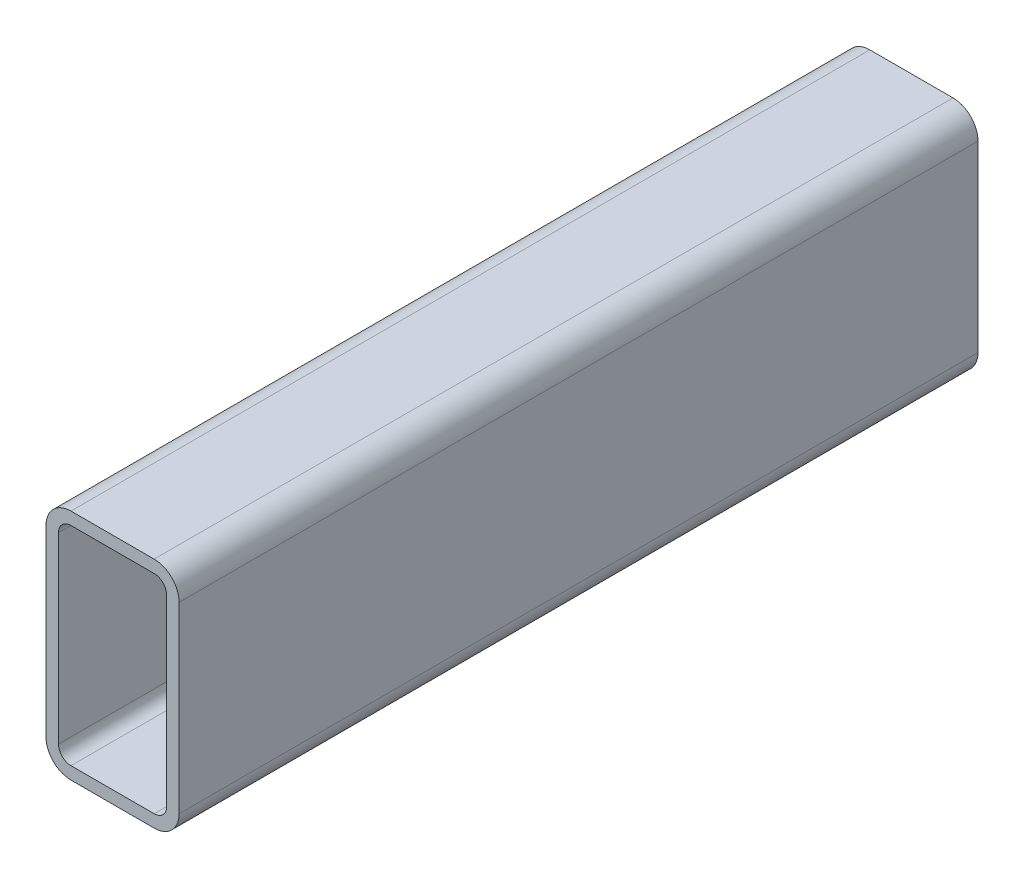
ISO-10303-21;
HEADER;
FILE_DESCRIPTION(('STEP AP214'),'2;1');
FILE_NAME('part.step','',(''),(''),'','','');
FILE_SCHEMA(('AUTOMOTIVE_DESIGN { 1 0 10303 214 1 1 1 1 }'));
ENDSEC;
DATA;
#1=APPLICATION_CONTEXT('core data for automotive mechanical design processes');
#2=APPLICATION_PROTOCOL_DEFINITION('international standard','automotive_design',2000,#1);
#3=PRODUCT_CONTEXT('',#1,'mechanical');
#4=PRODUCT('Part','Part','',(#3));
#5=PRODUCT_RELATED_PRODUCT_CATEGORY('part','',(#4));
#6=PRODUCT_DEFINITION_FORMATION('','',#4);
#7=PRODUCT_DEFINITION_CONTEXT('part definition',#1,'design');
#8=PRODUCT_DEFINITION('design','',#6,#7);
#9=PRODUCT_DEFINITION_SHAPE('','',#8);
#10=(LENGTH_UNIT() NAMED_UNIT(*) SI_UNIT(.MILLI.,.METRE.));
#11=(NAMED_UNIT(*) PLANE_ANGLE_UNIT() SI_UNIT($,.RADIAN.));
#12=(NAMED_UNIT(*) SI_UNIT($,.STERADIAN.) SOLID_ANGLE_UNIT());
#13=UNCERTAINTY_MEASURE_WITH_UNIT(LENGTH_MEASURE(1.E-05),#10,'distance_accuracy_value','');
#14=(GEOMETRIC_REPRESENTATION_CONTEXT(3) GLOBAL_UNCERTAINTY_ASSIGNED_CONTEXT((#13)) GLOBAL_UNIT_ASSIGNED_CONTEXT((#10,
#11,#12)) REPRESENTATION_CONTEXT('',''));
#15=CARTESIAN_POINT('',(0.,0.,0.));
#16=DIRECTION('',(0.,0.,1.));
#17=DIRECTION('',(1.,0.,0.));
#18=AXIS2_PLACEMENT_3D('',#15,#16,#17);
#19=CARTESIAN_POINT('',(9.525,79.375,304.8));
#20=DIRECTION('',(0.,0.,1.));
#21=DIRECTION('',(1.,0.,0.));
#22=AXIS2_PLACEMENT_3D('',#19,#20,#21);
#23=PLANE('',#22);
#24=CARTESIAN_POINT('',(9.525,79.375,304.8));
#25=DIRECTION('',(0.,0.,1.));
#26=DIRECTION('',(1.,0.,0.));
#27=AXIS2_PLACEMENT_3D('',#24,#25,#26);
#28=CIRCLE('',#27,9.525);
#29=CARTESIAN_POINT('',(9.525,88.9,304.8));
#30=VERTEX_POINT('',#29);
#31=CARTESIAN_POINT('',(0.,79.375,304.8));
#32=VERTEX_POINT('',#31);
#33=EDGE_CURVE('E211',#30,#32,#28,.T.);
#34=ORIENTED_EDGE('',*,*,#33,.T.);
#35=DIRECTION('',(0.,-1.,0.));
#36=VECTOR('',#35,1.);
#37=CARTESIAN_POINT('',(0.,9.525,304.8));
#38=LINE('',#37,#36);
#39=CARTESIAN_POINT('',(0.,9.525,304.8));
#40=VERTEX_POINT('',#39);
#41=EDGE_CURVE('E214',#32,#40,#38,.T.);
#42=ORIENTED_EDGE('',*,*,#41,.T.);
#43=CARTESIAN_POINT('',(9.525,9.525,304.8));
#44=DIRECTION('',(0.,0.,1.));
#45=DIRECTION('',(1.,0.,0.));
#46=AXIS2_PLACEMENT_3D('',#43,#44,#45);
#47=CIRCLE('',#46,9.525);
#48=CARTESIAN_POINT('',(9.525,0.,304.8));
#49=VERTEX_POINT('',#48);
#50=EDGE_CURVE('E217',#40,#49,#47,.T.);
#51=ORIENTED_EDGE('',*,*,#50,.T.);
#52=DIRECTION('',(1.,0.,0.));
#53=VECTOR('',#52,1.);
#54=CARTESIAN_POINT('',(41.275,0.,304.8));
#55=LINE('',#54,#53);
#56=CARTESIAN_POINT('',(41.275,0.,304.8));
#57=VERTEX_POINT('',#56);
#58=EDGE_CURVE('E219',#49,#57,#55,.T.);
#59=ORIENTED_EDGE('',*,*,#58,.T.);
#60=CARTESIAN_POINT('',(41.275,9.525,304.8));
#61=DIRECTION('',(0.,0.,1.));
#62=DIRECTION('',(1.,0.,0.));
#63=AXIS2_PLACEMENT_3D('',#60,#61,#62);
#64=CIRCLE('',#63,9.525);
#65=CARTESIAN_POINT('',(50.8,9.525,304.8));
#66=VERTEX_POINT('',#65);
#67=EDGE_CURVE('E221',#57,#66,#64,.T.);
#68=ORIENTED_EDGE('',*,*,#67,.T.);
#69=DIRECTION('',(0.,1.,0.));
#70=VECTOR('',#69,1.);
#71=CARTESIAN_POINT('',(50.8,79.375,304.8));
#72=LINE('',#71,#70);
#73=CARTESIAN_POINT('',(50.8,79.375,304.8));
#74=VERTEX_POINT('',#73);
#75=EDGE_CURVE('E223',#66,#74,#72,.T.);
#76=ORIENTED_EDGE('',*,*,#75,.T.);
#77=CARTESIAN_POINT('',(41.275,79.375,304.8));
#78=DIRECTION('',(0.,0.,1.));
#79=DIRECTION('',(1.,0.,0.));
#80=AXIS2_PLACEMENT_3D('',#77,#78,#79);
#81=CIRCLE('',#80,9.525);
#82=CARTESIAN_POINT('',(41.275,88.9,304.8));
#83=VERTEX_POINT('',#82);
#84=EDGE_CURVE('E225',#74,#83,#81,.T.);
#85=ORIENTED_EDGE('',*,*,#84,.T.);
#86=DIRECTION('',(-1.,0.,0.));
#87=VECTOR('',#86,1.);
#88=CARTESIAN_POINT('',(9.525,88.9,304.8));
#89=LINE('',#88,#87);
#90=EDGE_CURVE('E227',#83,#30,#89,.T.);
#91=ORIENTED_EDGE('',*,*,#90,.T.);
#92=EDGE_LOOP('',(#34,#42,#51,#59,#68,#76,#85,#91));
#93=FACE_BOUND('',#92,.T.);
#94=DIRECTION('',(0.,-1.,0.));
#95=VECTOR('',#94,1.);
#96=CARTESIAN_POINT('',(4.7625,9.525,304.8));
#97=LINE('',#96,#95);
#98=CARTESIAN_POINT('',(4.7625,79.375,304.8));
#99=VERTEX_POINT('',#98);
#100=CARTESIAN_POINT('',(4.7625,9.525,304.8));
#101=VERTEX_POINT('',#100);
#102=EDGE_CURVE('E154',#99,#101,#97,.T.);
#103=ORIENTED_EDGE('',*,*,#102,.F.);
#104=CARTESIAN_POINT('',(9.525,79.375,304.8));
#105=DIRECTION('',(0.,0.,1.));
#106=DIRECTION('',(1.,0.,0.));
#107=AXIS2_PLACEMENT_3D('',#104,#105,#106);
#108=CIRCLE('',#107,4.76249999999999);
#109=CARTESIAN_POINT('',(9.525,84.1375,304.8));
#110=VERTEX_POINT('',#109);
#111=EDGE_CURVE('E146',#110,#99,#108,.T.);
#112=ORIENTED_EDGE('',*,*,#111,.F.);
#113=DIRECTION('',(-1.,0.,0.));
#114=VECTOR('',#113,1.);
#115=CARTESIAN_POINT('',(9.525,84.1375,304.8));
#116=LINE('',#115,#114);
#117=CARTESIAN_POINT('',(41.275,84.1375,304.8));
#118=VERTEX_POINT('',#117);
#119=EDGE_CURVE('E179',#118,#110,#116,.T.);
#120=ORIENTED_EDGE('',*,*,#119,.F.);
#121=CARTESIAN_POINT('',(41.275,79.375,304.8));
#122=DIRECTION('',(0.,0.,1.));
#123=DIRECTION('',(1.,0.,0.));
#124=AXIS2_PLACEMENT_3D('',#121,#122,#123);
#125=CIRCLE('',#124,4.7625);
#126=CARTESIAN_POINT('',(46.0375,79.375,304.8));
#127=VERTEX_POINT('',#126);
#128=EDGE_CURVE('E177',#127,#118,#125,.T.);
#129=ORIENTED_EDGE('',*,*,#128,.F.);
#130=DIRECTION('',(0.,1.,0.));
#131=VECTOR('',#130,1.);
#132=CARTESIAN_POINT('',(46.0375,79.375,304.8));
#133=LINE('',#132,#131);
#134=CARTESIAN_POINT('',(46.0375,9.525,304.8));
#135=VERTEX_POINT('',#134);
#136=EDGE_CURVE('E175',#135,#127,#133,.T.);
#137=ORIENTED_EDGE('',*,*,#136,.F.);
#138=CARTESIAN_POINT('',(41.275,9.525,304.8));
#139=DIRECTION('',(0.,0.,1.));
#140=DIRECTION('',(1.,0.,0.));
#141=AXIS2_PLACEMENT_3D('',#138,#139,#140);
#142=CIRCLE('',#141,4.7625);
#143=CARTESIAN_POINT('',(41.275,4.7625,304.8));
#144=VERTEX_POINT('',#143);
#145=EDGE_CURVE('E173',#144,#135,#142,.T.);
#146=ORIENTED_EDGE('',*,*,#145,.F.);
#147=DIRECTION('',(1.,0.,0.));
#148=VECTOR('',#147,1.);
#149=CARTESIAN_POINT('',(41.275,4.7625,304.8));
#150=LINE('',#149,#148);
#151=CARTESIAN_POINT('',(9.525,4.7625,304.8));
#152=VERTEX_POINT('',#151);
#153=EDGE_CURVE('E169',#152,#144,#150,.T.);
#154=ORIENTED_EDGE('',*,*,#153,.F.);
#155=CARTESIAN_POINT('',(9.525,9.525,304.8));
#156=DIRECTION('',(0.,0.,1.));
#157=DIRECTION('',(1.,0.,0.));
#158=AXIS2_PLACEMENT_3D('',#155,#156,#157);
#159=CIRCLE('',#158,4.7625);
#160=EDGE_CURVE('E167',#101,#152,#159,.T.);
#161=ORIENTED_EDGE('',*,*,#160,.F.);
#162=EDGE_LOOP('',(#103,#112,#120,#129,#137,#146,#154,#161));
#163=FACE_BOUND('',#162,.T.);
#164=ADVANCED_FACE('F33',(#93,#163),#23,.T.);
#165=CARTESIAN_POINT('',(9.525,79.375,0.));
#166=DIRECTION('',(0.,0.,1.));
#167=DIRECTION('',(1.,0.,0.));
#168=AXIS2_PLACEMENT_3D('',#165,#166,#167);
#169=PLANE('',#168);
#170=CARTESIAN_POINT('',(9.525,79.375,0.));
#171=DIRECTION('',(0.,0.,1.));
#172=DIRECTION('',(1.,0.,0.));
#173=AXIS2_PLACEMENT_3D('',#170,#171,#172);
#174=CIRCLE('',#173,9.525);
#175=CARTESIAN_POINT('',(9.525,88.9,0.));
#176=VERTEX_POINT('',#175);
#177=CARTESIAN_POINT('',(0.,79.375,0.));
#178=VERTEX_POINT('',#177);
#179=EDGE_CURVE('E162',#176,#178,#174,.T.);
#180=ORIENTED_EDGE('',*,*,#179,.F.);
#181=DIRECTION('',(-1.,0.,0.));
#182=VECTOR('',#181,1.);
#183=CARTESIAN_POINT('',(9.525,88.9,0.));
#184=LINE('',#183,#182);
#185=CARTESIAN_POINT('',(41.275,88.9,0.));
#186=VERTEX_POINT('',#185);
#187=EDGE_CURVE('E215',#186,#176,#184,.T.);
#188=ORIENTED_EDGE('',*,*,#187,.F.);
#189=CARTESIAN_POINT('',(41.275,79.375,0.));
#190=DIRECTION('',(0.,0.,1.));
#191=DIRECTION('',(1.,0.,0.));
#192=AXIS2_PLACEMENT_3D('',#189,#190,#191);
#193=CIRCLE('',#192,9.525);
#194=CARTESIAN_POINT('',(50.8,79.375,0.));
#195=VERTEX_POINT('',#194);
#196=EDGE_CURVE('E242',#195,#186,#193,.T.);
#197=ORIENTED_EDGE('',*,*,#196,.F.);
#198=DIRECTION('',(0.,1.,0.));
#199=VECTOR('',#198,1.);
#200=CARTESIAN_POINT('',(50.8,79.375,0.));
#201=LINE('',#200,#199);
#202=CARTESIAN_POINT('',(50.8,9.525,0.));
#203=VERTEX_POINT('',#202);
#204=EDGE_CURVE('E240',#203,#195,#201,.T.);
#205=ORIENTED_EDGE('',*,*,#204,.F.);
#206=CARTESIAN_POINT('',(41.275,9.525,0.));
#207=DIRECTION('',(0.,0.,1.));
#208=DIRECTION('',(1.,0.,0.));
#209=AXIS2_PLACEMENT_3D('',#206,#207,#208);
#210=CIRCLE('',#209,9.525);
#211=CARTESIAN_POINT('',(41.275,0.,0.));
#212=VERTEX_POINT('',#211);
#213=EDGE_CURVE('E238',#212,#203,#210,.T.);
#214=ORIENTED_EDGE('',*,*,#213,.F.);
#215=DIRECTION('',(1.,0.,0.));
#216=VECTOR('',#215,1.);
#217=CARTESIAN_POINT('',(41.275,0.,0.));
#218=LINE('',#217,#216);
#219=CARTESIAN_POINT('',(9.525,0.,0.));
#220=VERTEX_POINT('',#219);
#221=EDGE_CURVE('E236',#220,#212,#218,.T.);
#222=ORIENTED_EDGE('',*,*,#221,.F.);
#223=CARTESIAN_POINT('',(9.525,9.525,0.));
#224=DIRECTION('',(0.,0.,1.));
#225=DIRECTION('',(1.,0.,0.));
#226=AXIS2_PLACEMENT_3D('',#223,#224,#225);
#227=CIRCLE('',#226,9.525);
#228=CARTESIAN_POINT('',(0.,9.525,0.));
#229=VERTEX_POINT('',#228);
#230=EDGE_CURVE('E234',#229,#220,#227,.T.);
#231=ORIENTED_EDGE('',*,*,#230,.F.);
#232=DIRECTION('',(0.,-1.,0.));
#233=VECTOR('',#232,1.);
#234=CARTESIAN_POINT('',(0.,9.525,0.));
#235=LINE('',#234,#233);
#236=EDGE_CURVE('E232',#178,#229,#235,.T.);
#237=ORIENTED_EDGE('',*,*,#236,.F.);
#238=EDGE_LOOP('',(#180,#188,#197,#205,#214,#222,#231,#237));
#239=FACE_BOUND('',#238,.T.);
#240=CARTESIAN_POINT('',(9.525,79.375,0.));
#241=DIRECTION('',(0.,0.,1.));
#242=DIRECTION('',(1.,0.,0.));
#243=AXIS2_PLACEMENT_3D('',#240,#241,#242);
#244=CIRCLE('',#243,4.76249999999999);
#245=CARTESIAN_POINT('',(9.525,84.1375,0.));
#246=VERTEX_POINT('',#245);
#247=CARTESIAN_POINT('',(4.7625,79.375,0.));
#248=VERTEX_POINT('',#247);
#249=EDGE_CURVE('E56',#246,#248,#244,.T.);
#250=ORIENTED_EDGE('',*,*,#249,.T.);
#251=DIRECTION('',(0.,-1.,0.));
#252=VECTOR('',#251,1.);
#253=CARTESIAN_POINT('',(4.7625,9.525,0.));
#254=LINE('',#253,#252);
#255=CARTESIAN_POINT('',(4.7625,9.525,0.));
#256=VERTEX_POINT('',#255);
#257=EDGE_CURVE('E161',#248,#256,#254,.T.);
#258=ORIENTED_EDGE('',*,*,#257,.T.);
#259=CARTESIAN_POINT('',(9.525,9.525,0.));
#260=DIRECTION('',(0.,0.,1.));
#261=DIRECTION('',(1.,0.,0.));
#262=AXIS2_PLACEMENT_3D('',#259,#260,#261);
#263=CIRCLE('',#262,4.7625);
#264=CARTESIAN_POINT('',(9.525,4.7625,0.));
#265=VERTEX_POINT('',#264);
#266=EDGE_CURVE('E183',#256,#265,#263,.T.);
#267=ORIENTED_EDGE('',*,*,#266,.T.);
#268=DIRECTION('',(1.,0.,0.));
#269=VECTOR('',#268,1.);
#270=CARTESIAN_POINT('',(41.275,4.7625,0.));
#271=LINE('',#270,#269);
#272=CARTESIAN_POINT('',(41.275,4.7625,0.));
#273=VERTEX_POINT('',#272);
#274=EDGE_CURVE('E186',#265,#273,#271,.T.);
#275=ORIENTED_EDGE('',*,*,#274,.T.);
#276=CARTESIAN_POINT('',(41.275,9.525,0.));
#277=DIRECTION('',(0.,0.,1.));
#278=DIRECTION('',(1.,0.,0.));
#279=AXIS2_PLACEMENT_3D('',#276,#277,#278);
#280=CIRCLE('',#279,4.7625);
#281=CARTESIAN_POINT('',(46.0375,9.525,0.));
#282=VERTEX_POINT('',#281);
#283=EDGE_CURVE('E189',#273,#282,#280,.T.);
#284=ORIENTED_EDGE('',*,*,#283,.T.);
#285=DIRECTION('',(0.,1.,0.));
#286=VECTOR('',#285,1.);
#287=CARTESIAN_POINT('',(46.0375,79.375,0.));
#288=LINE('',#287,#286);
#289=CARTESIAN_POINT('',(46.0375,79.375,0.));
#290=VERTEX_POINT('',#289);
#291=EDGE_CURVE('E192',#282,#290,#288,.T.);
#292=ORIENTED_EDGE('',*,*,#291,.T.);
#293=CARTESIAN_POINT('',(41.275,79.375,0.));
#294=DIRECTION('',(0.,0.,1.));
#295=DIRECTION('',(1.,0.,0.));
#296=AXIS2_PLACEMENT_3D('',#293,#294,#295);
#297=CIRCLE('',#296,4.7625);
#298=CARTESIAN_POINT('',(41.275,84.1375,0.));
#299=VERTEX_POINT('',#298);
#300=EDGE_CURVE('E195',#290,#299,#297,.T.);
#301=ORIENTED_EDGE('',*,*,#300,.T.);
#302=DIRECTION('',(-1.,0.,0.));
#303=VECTOR('',#302,1.);
#304=CARTESIAN_POINT('',(9.525,84.1375,0.));
#305=LINE('',#304,#303);
#306=EDGE_CURVE('E155',#299,#246,#305,.T.);
#307=ORIENTED_EDGE('',*,*,#306,.T.);
#308=EDGE_LOOP('',(#250,#258,#267,#275,#284,#292,#301,#307));
#309=FACE_BOUND('',#308,.T.);
#310=ADVANCED_FACE('F272',(#239,#309),#169,.F.);
#311=CARTESIAN_POINT('',(9.525,79.375,304.8));
#312=DIRECTION('',(0.,0.,-1.));
#313=DIRECTION('',(-1.,0.,0.));
#314=AXIS2_PLACEMENT_3D('',#311,#312,#313);
#315=CYLINDRICAL_SURFACE('',#314,9.525);
#316=ORIENTED_EDGE('',*,*,#179,.T.);
#317=DIRECTION('',(0.,0.,-1.));
#318=VECTOR('',#317,1.);
#319=CARTESIAN_POINT('',(0.,79.375,304.8));
#320=LINE('',#319,#318);
#321=EDGE_CURVE('E11',#32,#178,#320,.T.);
#322=ORIENTED_EDGE('',*,*,#321,.F.);
#323=ORIENTED_EDGE('',*,*,#33,.F.);
#324=DIRECTION('',(0.,0.,-1.));
#325=VECTOR('',#324,1.);
#326=CARTESIAN_POINT('',(9.525,88.9,304.8));
#327=LINE('',#326,#325);
#328=EDGE_CURVE('E229',#30,#176,#327,.T.);
#329=ORIENTED_EDGE('',*,*,#328,.T.);
#330=EDGE_LOOP('',(#316,#322,#323,#329));
#331=FACE_BOUND('',#330,.T.);
#332=ADVANCED_FACE('F35',(#331),#315,.T.);
#333=CARTESIAN_POINT('',(0.,9.525,304.8));
#334=DIRECTION('',(1.,0.,0.));
#335=DIRECTION('',(0.,0.,-1.));
#336=AXIS2_PLACEMENT_3D('',#333,#334,#335);
#337=PLANE('',#336);
#338=ORIENTED_EDGE('',*,*,#236,.T.);
#339=DIRECTION('',(0.,0.,-1.));
#340=VECTOR('',#339,1.);
#341=CARTESIAN_POINT('',(0.,9.525,304.8));
#342=LINE('',#341,#340);
#343=EDGE_CURVE('E41',#40,#229,#342,.T.);
#344=ORIENTED_EDGE('',*,*,#343,.F.);
#345=ORIENTED_EDGE('',*,*,#41,.F.);
#346=ORIENTED_EDGE('',*,*,#321,.T.);
#347=EDGE_LOOP('',(#338,#344,#345,#346));
#348=FACE_BOUND('',#347,.T.);
#349=ADVANCED_FACE('F289',(#348),#337,.F.);
#350=CARTESIAN_POINT('',(9.525,9.525,304.8));
#351=DIRECTION('',(0.,0.,-1.));
#352=DIRECTION('',(-1.,0.,0.));
#353=AXIS2_PLACEMENT_3D('',#350,#351,#352);
#354=CYLINDRICAL_SURFACE('',#353,9.525);
#355=ORIENTED_EDGE('',*,*,#230,.T.);
#356=DIRECTION('',(0.,0.,-1.));
#357=VECTOR('',#356,1.);
#358=CARTESIAN_POINT('',(9.525,0.,304.8));
#359=LINE('',#358,#357);
#360=EDGE_CURVE('E259',#49,#220,#359,.T.);
#361=ORIENTED_EDGE('',*,*,#360,.F.);
#362=ORIENTED_EDGE('',*,*,#50,.F.);
#363=ORIENTED_EDGE('',*,*,#343,.T.);
#364=EDGE_LOOP('',(#355,#361,#362,#363));
#365=FACE_BOUND('',#364,.T.);
#366=ADVANCED_FACE('F266',(#365),#354,.T.);
#367=CARTESIAN_POINT('',(41.275,0.,304.8));
#368=DIRECTION('',(0.,1.,0.));
#369=DIRECTION('',(0.,0.,1.));
#370=AXIS2_PLACEMENT_3D('',#367,#368,#369);
#371=PLANE('',#370);
#372=ORIENTED_EDGE('',*,*,#221,.T.);
#373=DIRECTION('',(0.,0.,-1.));
#374=VECTOR('',#373,1.);
#375=CARTESIAN_POINT('',(41.275,0.,304.8));
#376=LINE('',#375,#374);
#377=EDGE_CURVE('E256',#57,#212,#376,.T.);
#378=ORIENTED_EDGE('',*,*,#377,.F.);
#379=ORIENTED_EDGE('',*,*,#58,.F.);
#380=ORIENTED_EDGE('',*,*,#360,.T.);
#381=EDGE_LOOP('',(#372,#378,#379,#380));
#382=FACE_BOUND('',#381,.T.);
#383=ADVANCED_FACE('F278',(#382),#371,.F.);
#384=CARTESIAN_POINT('',(41.275,9.525,304.8));
#385=DIRECTION('',(0.,0.,-1.));
#386=DIRECTION('',(-1.,0.,0.));
#387=AXIS2_PLACEMENT_3D('',#384,#385,#386);
#388=CYLINDRICAL_SURFACE('',#387,9.525);
#389=ORIENTED_EDGE('',*,*,#213,.T.);
#390=DIRECTION('',(0.,0.,-1.));
#391=VECTOR('',#390,1.);
#392=CARTESIAN_POINT('',(50.8,9.525,304.8));
#393=LINE('',#392,#391);
#394=EDGE_CURVE('E253',#66,#203,#393,.T.);
#395=ORIENTED_EDGE('',*,*,#394,.F.);
#396=ORIENTED_EDGE('',*,*,#67,.F.);
#397=ORIENTED_EDGE('',*,*,#377,.T.);
#398=EDGE_LOOP('',(#389,#395,#396,#397));
#399=FACE_BOUND('',#398,.T.);
#400=ADVANCED_FACE('F282',(#399),#388,.T.);
#401=CARTESIAN_POINT('',(50.8,79.375,304.8));
#402=DIRECTION('',(-1.,0.,0.));
#403=DIRECTION('',(0.,0.,1.));
#404=AXIS2_PLACEMENT_3D('',#401,#402,#403);
#405=PLANE('',#404);
#406=ORIENTED_EDGE('',*,*,#204,.T.);
#407=DIRECTION('',(0.,0.,-1.));
#408=VECTOR('',#407,1.);
#409=CARTESIAN_POINT('',(50.8,79.375,304.8));
#410=LINE('',#409,#408);
#411=EDGE_CURVE('E250',#74,#195,#410,.T.);
#412=ORIENTED_EDGE('',*,*,#411,.F.);
#413=ORIENTED_EDGE('',*,*,#75,.F.);
#414=ORIENTED_EDGE('',*,*,#394,.T.);
#415=EDGE_LOOP('',(#406,#412,#413,#414));
#416=FACE_BOUND('',#415,.T.);
#417=ADVANCED_FACE('F302',(#416),#405,.F.);
#418=CARTESIAN_POINT('',(41.275,79.375,304.8));
#419=DIRECTION('',(0.,0.,-1.));
#420=DIRECTION('',(-1.,0.,0.));
#421=AXIS2_PLACEMENT_3D('',#418,#419,#420);
#422=CYLINDRICAL_SURFACE('',#421,9.525);
#423=ORIENTED_EDGE('',*,*,#196,.T.);
#424=DIRECTION('',(0.,0.,-1.));
#425=VECTOR('',#424,1.);
#426=CARTESIAN_POINT('',(41.275,88.9,304.8));
#427=LINE('',#426,#425);
#428=EDGE_CURVE('E247',#83,#186,#427,.T.);
#429=ORIENTED_EDGE('',*,*,#428,.F.);
#430=ORIENTED_EDGE('',*,*,#84,.F.);
#431=ORIENTED_EDGE('',*,*,#411,.T.);
#432=EDGE_LOOP('',(#423,#429,#430,#431));
#433=FACE_BOUND('',#432,.T.);
#434=ADVANCED_FACE('F300',(#433),#422,.T.);
#435=CARTESIAN_POINT('',(9.525,88.9,304.8));
#436=DIRECTION('',(0.,-1.,0.));
#437=DIRECTION('',(0.,0.,-1.));
#438=AXIS2_PLACEMENT_3D('',#435,#436,#437);
#439=PLANE('',#438);
#440=ORIENTED_EDGE('',*,*,#187,.T.);
#441=ORIENTED_EDGE('',*,*,#328,.F.);
#442=ORIENTED_EDGE('',*,*,#90,.F.);
#443=ORIENTED_EDGE('',*,*,#428,.T.);
#444=EDGE_LOOP('',(#440,#441,#442,#443));
#445=FACE_BOUND('',#444,.T.);
#446=ADVANCED_FACE('F295',(#445),#439,.F.);
#447=CARTESIAN_POINT('',(9.525,79.375,304.8));
#448=DIRECTION('',(0.,0.,-1.));
#449=DIRECTION('',(-1.,0.,0.));
#450=AXIS2_PLACEMENT_3D('',#447,#448,#449);
#451=CYLINDRICAL_SURFACE('',#450,4.76249999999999);
#452=ORIENTED_EDGE('',*,*,#249,.F.);
#453=DIRECTION('',(0.,0.,-1.));
#454=VECTOR('',#453,1.);
#455=CARTESIAN_POINT('',(9.525,84.1375,304.8));
#456=LINE('',#455,#454);
#457=EDGE_CURVE('E150',#110,#246,#456,.T.);
#458=ORIENTED_EDGE('',*,*,#457,.F.);
#459=ORIENTED_EDGE('',*,*,#111,.T.);
#460=DIRECTION('',(0.,0.,-1.));
#461=VECTOR('',#460,1.);
#462=CARTESIAN_POINT('',(4.7625,79.375,304.8));
#463=LINE('',#462,#461);
#464=EDGE_CURVE('E149',#99,#248,#463,.T.);
#465=ORIENTED_EDGE('',*,*,#464,.T.);
#466=EDGE_LOOP('',(#452,#458,#459,#465));
#467=FACE_BOUND('',#466,.T.);
#468=ADVANCED_FACE('F148',(#467),#451,.F.);
#469=CARTESIAN_POINT('',(4.7625,9.525,304.8));
#470=DIRECTION('',(1.,0.,0.));
#471=DIRECTION('',(0.,0.,-1.));
#472=AXIS2_PLACEMENT_3D('',#469,#470,#471);
#473=PLANE('',#472);
#474=ORIENTED_EDGE('',*,*,#257,.F.);
#475=ORIENTED_EDGE('',*,*,#464,.F.);
#476=ORIENTED_EDGE('',*,*,#102,.T.);
#477=DIRECTION('',(0.,0.,-1.));
#478=VECTOR('',#477,1.);
#479=CARTESIAN_POINT('',(4.7625,9.525,304.8));
#480=LINE('',#479,#478);
#481=EDGE_CURVE('E163',#101,#256,#480,.T.);
#482=ORIENTED_EDGE('',*,*,#481,.T.);
#483=EDGE_LOOP('',(#474,#475,#476,#482));
#484=FACE_BOUND('',#483,.T.);
#485=ADVANCED_FACE('F158',(#484),#473,.T.);
#486=CARTESIAN_POINT('',(9.525,9.525,304.8));
#487=DIRECTION('',(0.,0.,-1.));
#488=DIRECTION('',(-1.,0.,0.));
#489=AXIS2_PLACEMENT_3D('',#486,#487,#488);
#490=CYLINDRICAL_SURFACE('',#489,4.7625);
#491=ORIENTED_EDGE('',*,*,#266,.F.);
#492=ORIENTED_EDGE('',*,*,#481,.F.);
#493=ORIENTED_EDGE('',*,*,#160,.T.);
#494=DIRECTION('',(0.,0.,-1.));
#495=VECTOR('',#494,1.);
#496=CARTESIAN_POINT('',(9.525,4.7625,304.8));
#497=LINE('',#496,#495);
#498=EDGE_CURVE('E208',#152,#265,#497,.T.);
#499=ORIENTED_EDGE('',*,*,#498,.T.);
#500=EDGE_LOOP('',(#491,#492,#493,#499));
#501=FACE_BOUND('',#500,.T.);
#502=ADVANCED_FACE('F327',(#501),#490,.F.);
#503=CARTESIAN_POINT('',(41.275,4.7625,304.8));
#504=DIRECTION('',(0.,1.,0.));
#505=DIRECTION('',(0.,0.,1.));
#506=AXIS2_PLACEMENT_3D('',#503,#504,#505);
#507=PLANE('',#506);
#508=ORIENTED_EDGE('',*,*,#274,.F.);
#509=ORIENTED_EDGE('',*,*,#498,.F.);
#510=ORIENTED_EDGE('',*,*,#153,.T.);
#511=DIRECTION('',(0.,0.,-1.));
#512=VECTOR('',#511,1.);
#513=CARTESIAN_POINT('',(41.275,4.7625,304.8));
#514=LINE('',#513,#512);
#515=EDGE_CURVE('E206',#144,#273,#514,.T.);
#516=ORIENTED_EDGE('',*,*,#515,.T.);
#517=EDGE_LOOP('',(#508,#509,#510,#516));
#518=FACE_BOUND('',#517,.T.);
#519=ADVANCED_FACE('F331',(#518),#507,.T.);
#520=CARTESIAN_POINT('',(41.275,9.525,304.8));
#521=DIRECTION('',(0.,0.,-1.));
#522=DIRECTION('',(-1.,0.,0.));
#523=AXIS2_PLACEMENT_3D('',#520,#521,#522);
#524=CYLINDRICAL_SURFACE('',#523,4.7625);
#525=ORIENTED_EDGE('',*,*,#283,.F.);
#526=ORIENTED_EDGE('',*,*,#515,.F.);
#527=ORIENTED_EDGE('',*,*,#145,.T.);
#528=DIRECTION('',(0.,0.,-1.));
#529=VECTOR('',#528,1.);
#530=CARTESIAN_POINT('',(46.0375,9.525,304.8));
#531=LINE('',#530,#529);
#532=EDGE_CURVE('E204',#135,#282,#531,.T.);
#533=ORIENTED_EDGE('',*,*,#532,.T.);
#534=EDGE_LOOP('',(#525,#526,#527,#533));
#535=FACE_BOUND('',#534,.T.);
#536=ADVANCED_FACE('F337',(#535),#524,.F.);
#537=CARTESIAN_POINT('',(46.0375,79.375,304.8));
#538=DIRECTION('',(-1.,0.,0.));
#539=DIRECTION('',(0.,0.,1.));
#540=AXIS2_PLACEMENT_3D('',#537,#538,#539);
#541=PLANE('',#540);
#542=ORIENTED_EDGE('',*,*,#291,.F.);
#543=ORIENTED_EDGE('',*,*,#532,.F.);
#544=ORIENTED_EDGE('',*,*,#136,.T.);
#545=DIRECTION('',(0.,0.,-1.));
#546=VECTOR('',#545,1.);
#547=CARTESIAN_POINT('',(46.0375,79.375,304.8));
#548=LINE('',#547,#546);
#549=EDGE_CURVE('E202',#127,#290,#548,.T.);
#550=ORIENTED_EDGE('',*,*,#549,.T.);
#551=EDGE_LOOP('',(#542,#543,#544,#550));
#552=FACE_BOUND('',#551,.T.);
#553=ADVANCED_FACE('F341',(#552),#541,.T.);
#554=CARTESIAN_POINT('',(41.275,79.375,304.8));
#555=DIRECTION('',(0.,0.,-1.));
#556=DIRECTION('',(-1.,0.,0.));
#557=AXIS2_PLACEMENT_3D('',#554,#555,#556);
#558=CYLINDRICAL_SURFACE('',#557,4.7625);
#559=ORIENTED_EDGE('',*,*,#300,.F.);
#560=ORIENTED_EDGE('',*,*,#549,.F.);
#561=ORIENTED_EDGE('',*,*,#128,.T.);
#562=DIRECTION('',(0.,0.,-1.));
#563=VECTOR('',#562,1.);
#564=CARTESIAN_POINT('',(41.275,84.1375,304.8));
#565=LINE('',#564,#563);
#566=EDGE_CURVE('E48',#118,#299,#565,.T.);
#567=ORIENTED_EDGE('',*,*,#566,.T.);
#568=EDGE_LOOP('',(#559,#560,#561,#567));
#569=FACE_BOUND('',#568,.T.);
#570=ADVANCED_FACE('F345',(#569),#558,.F.);
#571=CARTESIAN_POINT('',(9.525,84.1375,304.8));
#572=DIRECTION('',(0.,-1.,0.));
#573=DIRECTION('',(0.,0.,-1.));
#574=AXIS2_PLACEMENT_3D('',#571,#572,#573);
#575=PLANE('',#574);
#576=ORIENTED_EDGE('',*,*,#306,.F.);
#577=ORIENTED_EDGE('',*,*,#566,.F.);
#578=ORIENTED_EDGE('',*,*,#119,.T.);
#579=ORIENTED_EDGE('',*,*,#457,.T.);
#580=EDGE_LOOP('',(#576,#577,#578,#579));
#581=FACE_BOUND('',#580,.T.);
#582=ADVANCED_FACE('F349',(#581),#575,.T.);
#583=CLOSED_SHELL('',(#164,#310,#332,#349,#366,#383,#400,#417,#434,#446,#468,#485,#502,#519,
#536,#553,#570,#582));
#584=MANIFOLD_SOLID_BREP('B2',#583);
#585=ADVANCED_BREP_SHAPE_REPRESENTATION('',(#18,#584),#14);
#586=SHAPE_DEFINITION_REPRESENTATION(#9,#585);
ENDSEC;
END-ISO-10303-21;
